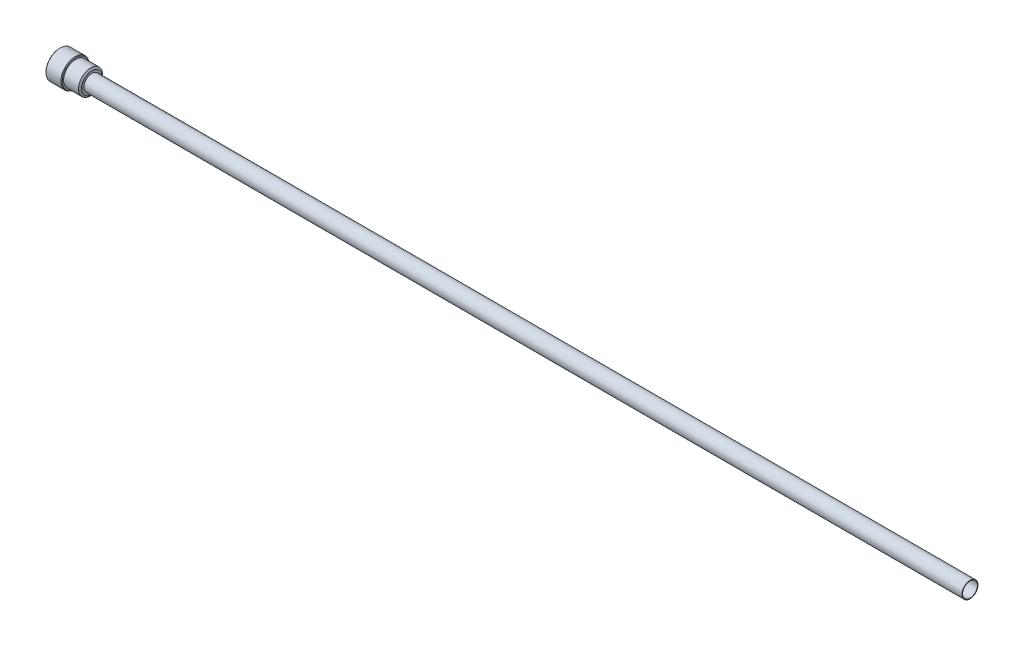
ISO-10303-21;
HEADER;
FILE_DESCRIPTION(('STEP AP214'),'2;1');
FILE_NAME('part.step','',(''),(''),'','','');
FILE_SCHEMA(('AUTOMOTIVE_DESIGN { 1 0 10303 214 1 1 1 1 }'));
ENDSEC;
DATA;
#1=APPLICATION_CONTEXT('core data for automotive mechanical design processes');
#2=APPLICATION_PROTOCOL_DEFINITION('international standard','automotive_design',2000,#1);
#3=PRODUCT_CONTEXT('',#1,'mechanical');
#4=PRODUCT('Part','Part','',(#3));
#5=PRODUCT_RELATED_PRODUCT_CATEGORY('part','',(#4));
#6=PRODUCT_DEFINITION_FORMATION('','',#4);
#7=PRODUCT_DEFINITION_CONTEXT('part definition',#1,'design');
#8=PRODUCT_DEFINITION('design','',#6,#7);
#9=PRODUCT_DEFINITION_SHAPE('','',#8);
#10=(LENGTH_UNIT() NAMED_UNIT(*) SI_UNIT(.MILLI.,.METRE.));
#11=(NAMED_UNIT(*) PLANE_ANGLE_UNIT() SI_UNIT($,.RADIAN.));
#12=(NAMED_UNIT(*) SI_UNIT($,.STERADIAN.) SOLID_ANGLE_UNIT());
#13=UNCERTAINTY_MEASURE_WITH_UNIT(LENGTH_MEASURE(1.E-05),#10,'distance_accuracy_value','');
#14=(GEOMETRIC_REPRESENTATION_CONTEXT(3) GLOBAL_UNCERTAINTY_ASSIGNED_CONTEXT((#13)) GLOBAL_UNIT_ASSIGNED_CONTEXT((#10,
#11,#12)) REPRESENTATION_CONTEXT('',''));
#15=CARTESIAN_POINT('',(0.,0.,0.));
#16=DIRECTION('',(0.,0.,1.));
#17=DIRECTION('',(1.,0.,0.));
#18=AXIS2_PLACEMENT_3D('',#15,#16,#17);
#19=CARTESIAN_POINT('',(0.,0.,0.));
#20=DIRECTION('',(-1.,0.,0.));
#21=DIRECTION('',(0.,0.,1.));
#22=AXIS2_PLACEMENT_3D('',#19,#20,#21);
#23=CONICAL_SURFACE('',#22,4.59999999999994,0.785398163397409);
#24=CARTESIAN_POINT('',(-0.000200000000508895,3.96758228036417,-2.32811745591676));
#25=CARTESIAN_POINT('',(0.0770394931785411,3.83202612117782,-2.40638084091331));
#26=CARTESIAN_POINT('',(0.149654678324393,3.69422306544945,-2.48594147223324));
#27=CARTESIAN_POINT('',(0.282453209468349,3.41334042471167,-2.64810914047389));
#28=CARTESIAN_POINT('',(0.342565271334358,3.27023578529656,-2.73073064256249));
#29=CARTESIAN_POINT('',(0.445444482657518,2.98169480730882,-2.89731985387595));
#30=CARTESIAN_POINT('',(0.488462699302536,2.83632753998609,-2.98124768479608));
#31=CARTESIAN_POINT('',(0.55464811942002,2.54248765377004,-3.15089622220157));
#32=CARTESIAN_POINT('',(0.577862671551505,2.39402331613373,-3.23661214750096));
#33=CARTESIAN_POINT('',(0.598847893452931,2.13654093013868,-3.38526967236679));
#34=CARTESIAN_POINT('',(0.601837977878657,2.02783001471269,-3.44803394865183));
#35=CARTESIAN_POINT('',(0.595987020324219,1.81060401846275,-3.57344943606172));
#36=CARTESIAN_POINT('',(0.587141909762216,1.7020890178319,-3.63610060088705));
#37=CARTESIAN_POINT('',(0.558126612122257,1.48610778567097,-3.76079742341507));
#38=CARTESIAN_POINT('',(0.537944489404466,1.37864278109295,-3.82284237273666));
#39=CARTESIAN_POINT('',(0.487352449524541,1.16556616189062,-3.94586221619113));
#40=CARTESIAN_POINT('',(0.4569433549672,1.05995439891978,-4.00683719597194));
#41=CARTESIAN_POINT('',(0.395534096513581,0.875728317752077,-4.11320017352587));
#42=CARTESIAN_POINT('',(0.366379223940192,0.796643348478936,-4.15885990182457));
#43=CARTESIAN_POINT('',(0.303546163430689,0.639837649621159,-4.24939171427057));
#44=CARTESIAN_POINT('',(0.269868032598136,0.562116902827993,-4.29426380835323));
#45=CARTESIAN_POINT('',(0.198699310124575,0.408289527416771,-4.38307608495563));
#46=CARTESIAN_POINT('',(0.161221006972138,0.332178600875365,-4.42701874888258));
#47=CARTESIAN_POINT('',(0.0829037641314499,0.18130797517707,-4.5141239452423));
#48=CARTESIAN_POINT('',(0.0420665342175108,0.106547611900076,-4.55728686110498));
#49=CARTESIAN_POINT('',(-0.000200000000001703,0.0324177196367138,-4.60008577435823));
#50=B_SPLINE_CURVE_WITH_KNOTS('',3,(#24,#25,#26,#27,#28,#29,#30,#31,#32,#33,#34,#35,#36,#37,#38,
#39,#40,#41,#42,#43,#44,#45,#46,#47,#48,#49),.UNSPECIFIED.,.F.,.F.,(4,2,2,2,2,2,2,2,2,2,2,2,4),
(0.,0.523989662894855,1.05088947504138,1.56973581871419,2.08733814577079,2.46349746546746,
2.83978613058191,3.21647169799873,3.59312697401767,3.88058628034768,4.16804195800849,
4.45459607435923,4.74100521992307),.UNSPECIFIED.);
#51=CARTESIAN_POINT('',(0.,3.96723155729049,-2.32831994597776));
#52=VERTEX_POINT('',#51);
#53=CARTESIAN_POINT('',(0.,0.0327684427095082,-4.59988328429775));
#54=VERTEX_POINT('',#53);
#55=EDGE_CURVE('E12',#52,#54,#50,.T.);
#56=ORIENTED_EDGE('',*,*,#55,.F.);
#57=CARTESIAN_POINT('',(0.,0.,0.));
#58=DIRECTION('',(1.,0.,0.));
#59=DIRECTION('',(0.,0.,-1.));
#60=AXIS2_PLACEMENT_3D('',#57,#58,#59);
#61=CIRCLE('',#60,4.59999999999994);
#62=EDGE_CURVE('E190',#54,#52,#61,.T.);
#63=ORIENTED_EDGE('',*,*,#62,.F.);
#64=EDGE_LOOP('',(#56,#63));
#65=FACE_BOUND('',#64,.T.);
#66=ADVANCED_FACE('F33',(#65),#23,.F.);
#67=CARTESIAN_POINT('',(-0.000200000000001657,-0.032417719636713,-4.60008577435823));
#68=CARTESIAN_POINT('',(0.0770394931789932,-0.167973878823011,-4.52182238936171));
#69=CARTESIAN_POINT('',(0.149654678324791,-0.305776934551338,-4.44226175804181));
#70=CARTESIAN_POINT('',(0.282453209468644,-0.586659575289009,-4.28009408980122));
#71=CARTESIAN_POINT('',(0.342565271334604,-0.729764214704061,-4.19747258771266));
#72=CARTESIAN_POINT('',(0.445444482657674,-1.01830519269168,-4.03088337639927));
#73=CARTESIAN_POINT('',(0.488462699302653,-1.16367246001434,-3.94695554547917));
#74=CARTESIAN_POINT('',(0.554648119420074,-1.45751234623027,-3.77730700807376));
#75=CARTESIAN_POINT('',(0.577862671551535,-1.60597668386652,-3.69159108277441));
#76=CARTESIAN_POINT('',(0.598847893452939,-1.8634590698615,-3.54293355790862));
#77=CARTESIAN_POINT('',(0.601837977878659,-1.97216998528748,-3.48016928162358));
#78=CARTESIAN_POINT('',(0.595987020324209,-2.18939598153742,-3.35475379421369));
#79=CARTESIAN_POINT('',(0.5871419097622,-2.29791098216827,-3.29210262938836));
#80=CARTESIAN_POINT('',(0.558126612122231,-2.51389221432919,-3.16740580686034));
#81=CARTESIAN_POINT('',(0.537944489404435,-2.62135721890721,-3.10536085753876));
#82=CARTESIAN_POINT('',(0.487352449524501,-2.83443383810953,-2.98234101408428));
#83=CARTESIAN_POINT('',(0.456943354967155,-2.94004560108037,-2.92136603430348));
#84=CARTESIAN_POINT('',(0.395534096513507,-3.12427168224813,-2.81500305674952));
#85=CARTESIAN_POINT('',(0.366379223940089,-3.20335665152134,-2.76934332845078));
#86=CARTESIAN_POINT('',(0.303546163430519,-3.36016235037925,-2.6788115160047));
#87=CARTESIAN_POINT('',(0.269868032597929,-3.43788309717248,-2.63393942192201));
#88=CARTESIAN_POINT('',(0.198699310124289,-3.59171047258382,-2.54512714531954));
#89=CARTESIAN_POINT('',(0.161221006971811,-3.66782139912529,-2.50118448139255));
#90=CARTESIAN_POINT('',(0.0829037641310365,-3.8186920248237,-2.41407928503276));
#91=CARTESIAN_POINT('',(0.0420665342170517,-3.89345238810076,-2.37091636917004));
#92=CARTESIAN_POINT('',(-0.000200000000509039,-3.96758228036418,-2.32811745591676));
#93=B_SPLINE_CURVE_WITH_KNOTS('',3,(#67,#68,#69,#70,#71,#72,#73,#74,#75,#76,#77,#78,#79,#80,#81,
#82,#83,#84,#85,#86,#87,#88,#89,#90,#91,#92),.UNSPECIFIED.,.F.,.F.,(4,2,2,2,2,2,2,2,2,2,2,2,4),
(0.,0.523989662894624,1.05088947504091,1.56973581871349,2.08733814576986,2.46349746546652,
2.83978613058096,3.21647169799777,3.59312697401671,3.88058628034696,4.16804195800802,
4.45459607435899,4.74100521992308),.UNSPECIFIED.);
#94=CARTESIAN_POINT('',(0.,-0.0327684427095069,-4.59988328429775));
#95=VERTEX_POINT('',#94);
#96=CARTESIAN_POINT('',(0.,-3.96723155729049,-2.32831994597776));
#97=VERTEX_POINT('',#96);
#98=EDGE_CURVE('E46',#95,#97,#93,.T.);
#99=ORIENTED_EDGE('',*,*,#98,.F.);
#100=EDGE_CURVE('E187',#97,#95,#61,.T.);
#101=ORIENTED_EDGE('',*,*,#100,.F.);
#102=EDGE_LOOP('',(#99,#101));
#103=FACE_BOUND('',#102,.T.);
#104=ADVANCED_FACE('F293',(#103),#23,.F.);
#105=CARTESIAN_POINT('',(-1.65737932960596,-4.,-4.81194306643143));
#106=CARTESIAN_POINT('',(-1.56797699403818,-4.,-4.69565947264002));
#107=CARTESIAN_POINT('',(-1.47937788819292,-4.,-4.57874845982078));
#108=CARTESIAN_POINT('',(-1.30415284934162,-4.,-4.34341545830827));
#109=CARTESIAN_POINT('',(-1.21752738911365,-4.,-4.22499311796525));
#110=CARTESIAN_POINT('',(-1.04599986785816,-4.,-3.98551584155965));
#111=CARTESIAN_POINT('',(-0.961116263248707,-4.,-3.86444764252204));
#112=CARTESIAN_POINT('',(-0.794310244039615,-4.,-3.62029483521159));
#113=CARTESIAN_POINT('',(-0.712387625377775,-4.,-3.49721036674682));
#114=CARTESIAN_POINT('',(-0.547116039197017,-4.,-3.24083487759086));
#115=CARTESIAN_POINT('',(-0.464004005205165,-4.,-3.10739034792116));
#116=CARTESIAN_POINT('',(-0.302949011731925,-4.,-2.83736805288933));
#117=CARTESIAN_POINT('',(-0.225006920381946,-4.,-2.70078976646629));
#118=CARTESIAN_POINT('',(-0.0759524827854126,-4.,-2.42446434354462));
#119=CARTESIAN_POINT('',(-0.00482008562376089,-4.,-2.28472810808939));
#120=CARTESIAN_POINT('',(0.129021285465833,-4.,-2.00131014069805));
#121=CARTESIAN_POINT('',(0.191734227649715,-4.,-1.85763030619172));
#122=CARTESIAN_POINT('',(0.300838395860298,-4.,-1.58031488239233));
#123=CARTESIAN_POINT('',(0.34822705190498,-4.,-1.44707574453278));
#124=CARTESIAN_POINT('',(0.432338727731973,-4.,-1.17720941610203));
#125=CARTESIAN_POINT('',(0.469061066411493,-4.,-1.0405820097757));
#126=CARTESIAN_POINT('',(0.529242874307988,-4.,-0.767130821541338));
#127=CARTESIAN_POINT('',(0.552942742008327,-4.,-0.630360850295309));
#128=CARTESIAN_POINT('',(0.586586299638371,-4.,-0.355129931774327));
#129=CARTESIAN_POINT('',(0.596532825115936,-4.,-0.216669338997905));
#130=CARTESIAN_POINT('',(0.601826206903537,-4.,0.0545157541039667));
#131=CARTESIAN_POINT('',(0.597788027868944,-4.,0.187228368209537));
#132=CARTESIAN_POINT('',(0.576744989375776,-4.,0.451614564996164));
#133=CARTESIAN_POINT('',(0.559738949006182,-4.,0.583288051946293));
#134=CARTESIAN_POINT('',(0.513431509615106,-4.,0.846874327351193));
#135=CARTESIAN_POINT('',(0.483913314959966,-4.,0.978748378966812));
#136=CARTESIAN_POINT('',(0.414216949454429,-4.,1.23959359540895));
#137=CARTESIAN_POINT('',(0.374039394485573,-4.,1.36856492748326));
#138=CARTESIAN_POINT('',(0.282162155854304,-4.,1.63085879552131));
#139=CARTESIAN_POINT('',(0.229923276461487,-4.,1.76399030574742));
#140=CARTESIAN_POINT('',(0.117376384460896,-4.,2.02682798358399));
#141=CARTESIAN_POINT('',(0.057064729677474,-4.,2.156532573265));
#142=CARTESIAN_POINT('',(-0.070197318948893,-4.,2.41312958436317));
#143=CARTESIAN_POINT('',(-0.137168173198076,-4.,2.54001177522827));
#144=CARTESIAN_POINT('',(-0.276274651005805,-4.,2.7908683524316));
#145=CARTESIAN_POINT('',(-0.348409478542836,-4.,2.91484318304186));
#146=CARTESIAN_POINT('',(-0.493170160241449,-4.,3.15420495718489));
#147=CARTESIAN_POINT('',(-0.565595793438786,-4.,3.26971363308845));
#148=CARTESIAN_POINT('',(-0.713528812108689,-4.,3.49874649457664));
#149=CARTESIAN_POINT('',(-0.789036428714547,-4.,3.61227053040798));
#150=CARTESIAN_POINT('',(-0.941968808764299,-4.,3.83668078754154));
#151=CARTESIAN_POINT('',(-1.01937330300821,-4.,3.94758087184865));
#152=CARTESIAN_POINT('',(-1.17625644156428,-4.,4.16785980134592));
#153=CARTESIAN_POINT('',(-1.25573450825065,-4.,4.27723905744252));
#154=CARTESIAN_POINT('',(-1.3360613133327,-4.,4.38598038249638));
#155=B_SPLINE_CURVE_WITH_KNOTS('',3,(#105,#106,#107,#108,#109,#110,#111,#112,#113,#114,#115,
#116,#117,#118,#119,#120,#121,#122,#123,#124,#125,#126,#127,#128,#129,#130,#131,#132,#133,#134,
#135,#136,#137,#138,#139,#140,#141,#142,#143,#144,#145,#146,#147,#148,#149,#150,#151,#152,#153,
#154),.UNSPECIFIED.,.F.,.F.,(4,2,2,2,2,2,2,2,2,2,2,2,2,2,2,2,2,2,2,2,2,2,2,2,4),(0.,
0.440044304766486,0.880192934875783,1.32373793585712,1.76725231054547,2.2387898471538,
2.71040636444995,3.18058851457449,3.65054827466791,4.0744289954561,4.49833677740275,
4.91413096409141,5.32983941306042,5.72750387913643,6.12520456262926,6.53009753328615,
6.93496711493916,7.36367914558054,7.79258525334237,8.22285247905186,8.65305352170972,
9.06200662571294,9.47099045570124,9.87668939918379,10.2822765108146),.UNSPECIFIED.);
#156=CARTESIAN_POINT('',(0.,-4.,-2.27156333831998));
#157=VERTEX_POINT('',#156);
#158=CARTESIAN_POINT('',(0.,-4.,2.27156333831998));
#159=VERTEX_POINT('',#158);
#160=EDGE_CURVE('E267',#157,#159,#155,.T.);
#161=ORIENTED_EDGE('',*,*,#160,.F.);
#162=EDGE_CURVE('E294',#159,#157,#61,.T.);
#163=ORIENTED_EDGE('',*,*,#162,.F.);
#164=EDGE_LOOP('',(#161,#163));
#165=FACE_BOUND('',#164,.T.);
#166=ADVANCED_FACE('F340',(#165),#23,.F.);
#167=CARTESIAN_POINT('',(-0.000200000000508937,-3.96758228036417,2.32811745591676));
#168=CARTESIAN_POINT('',(0.0770394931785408,-3.83202612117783,2.40638084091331));
#169=CARTESIAN_POINT('',(0.149654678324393,-3.69422306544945,2.48594147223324));
#170=CARTESIAN_POINT('',(0.282453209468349,-3.41334042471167,2.64810914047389));
#171=CARTESIAN_POINT('',(0.342565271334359,-3.27023578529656,2.73073064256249));
#172=CARTESIAN_POINT('',(0.445444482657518,-2.98169480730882,2.89731985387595));
#173=CARTESIAN_POINT('',(0.488462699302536,-2.8363275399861,2.98124768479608));
#174=CARTESIAN_POINT('',(0.55464811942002,-2.54248765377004,3.15089622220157));
#175=CARTESIAN_POINT('',(0.577862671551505,-2.39402331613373,3.23661214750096));
#176=CARTESIAN_POINT('',(0.59884789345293,-2.13654093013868,3.38526967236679));
#177=CARTESIAN_POINT('',(0.601837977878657,-2.02783001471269,3.44803394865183));
#178=CARTESIAN_POINT('',(0.595987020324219,-1.81060401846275,3.57344943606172));
#179=CARTESIAN_POINT('',(0.587141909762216,-1.7020890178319,3.63610060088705));
#180=CARTESIAN_POINT('',(0.558126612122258,-1.48610778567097,3.76079742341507));
#181=CARTESIAN_POINT('',(0.537944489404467,-1.37864278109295,3.82284237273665));
#182=CARTESIAN_POINT('',(0.487352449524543,-1.16556616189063,3.94586221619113));
#183=CARTESIAN_POINT('',(0.4569433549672,-1.05995439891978,4.00683719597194));
#184=CARTESIAN_POINT('',(0.395534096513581,-0.875728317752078,4.11320017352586));
#185=CARTESIAN_POINT('',(0.366379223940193,-0.796643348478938,4.15885990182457));
#186=CARTESIAN_POINT('',(0.30354616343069,-0.63983764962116,4.24939171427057));
#187=CARTESIAN_POINT('',(0.269868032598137,-0.562116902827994,4.29426380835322));
#188=CARTESIAN_POINT('',(0.198699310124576,-0.408289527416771,4.38307608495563));
#189=CARTESIAN_POINT('',(0.161221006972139,-0.332178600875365,4.42701874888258));
#190=CARTESIAN_POINT('',(0.0829037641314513,-0.181307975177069,4.5141239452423));
#191=CARTESIAN_POINT('',(0.042066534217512,-0.106547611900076,4.55728686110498));
#192=CARTESIAN_POINT('',(-0.000200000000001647,-0.0324177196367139,4.60008577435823));
#193=B_SPLINE_CURVE_WITH_KNOTS('',3,(#167,#168,#169,#170,#171,#172,#173,#174,#175,#176,#177,
#178,#179,#180,#181,#182,#183,#184,#185,#186,#187,#188,#189,#190,#191,#192),.UNSPECIFIED.,.F.,
.F.,(4,2,2,2,2,2,2,2,2,2,2,2,4),(0.,0.523989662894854,1.05088947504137,1.56973581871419,
2.08733814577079,2.46349746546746,2.83978613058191,3.21647169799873,3.59312697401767,
3.88058628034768,4.16804195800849,4.45459607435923,4.74100521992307),.UNSPECIFIED.);
#194=CARTESIAN_POINT('',(0.,-3.96723155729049,2.32831994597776));
#195=VERTEX_POINT('',#194);
#196=CARTESIAN_POINT('',(0.,-0.0327684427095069,4.59988328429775));
#197=VERTEX_POINT('',#196);
#198=EDGE_CURVE('E271',#195,#197,#193,.T.);
#199=ORIENTED_EDGE('',*,*,#198,.F.);
#200=EDGE_CURVE('E295',#197,#195,#61,.T.);
#201=ORIENTED_EDGE('',*,*,#200,.F.);
#202=EDGE_LOOP('',(#199,#201));
#203=FACE_BOUND('',#202,.T.);
#204=ADVANCED_FACE('F338',(#203),#23,.F.);
#205=CARTESIAN_POINT('',(-0.000200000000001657,0.0324177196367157,4.60008577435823));
#206=CARTESIAN_POINT('',(0.0770394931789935,0.167973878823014,4.52182238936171));
#207=CARTESIAN_POINT('',(0.149654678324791,0.305776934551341,4.44226175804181));
#208=CARTESIAN_POINT('',(0.282453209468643,0.586659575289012,4.28009408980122));
#209=CARTESIAN_POINT('',(0.342565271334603,0.729764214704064,4.19747258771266));
#210=CARTESIAN_POINT('',(0.445444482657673,1.01830519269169,4.03088337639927));
#211=CARTESIAN_POINT('',(0.488462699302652,1.16367246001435,3.94695554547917));
#212=CARTESIAN_POINT('',(0.554648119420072,1.45751234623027,3.77730700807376));
#213=CARTESIAN_POINT('',(0.577862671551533,1.60597668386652,3.69159108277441));
#214=CARTESIAN_POINT('',(0.598847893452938,1.8634590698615,3.54293355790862));
#215=CARTESIAN_POINT('',(0.601837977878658,1.97216998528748,3.48016928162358));
#216=CARTESIAN_POINT('',(0.595987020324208,2.18939598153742,3.35475379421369));
#217=CARTESIAN_POINT('',(0.587141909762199,2.29791098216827,3.29210262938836));
#218=CARTESIAN_POINT('',(0.558126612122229,2.51389221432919,3.16740580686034));
#219=CARTESIAN_POINT('',(0.537944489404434,2.62135721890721,3.10536085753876));
#220=CARTESIAN_POINT('',(0.4873524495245,2.83443383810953,2.98234101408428));
#221=CARTESIAN_POINT('',(0.456943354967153,2.94004560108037,2.92136603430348));
#222=CARTESIAN_POINT('',(0.395534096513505,3.12427168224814,2.81500305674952));
#223=CARTESIAN_POINT('',(0.366379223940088,3.20335665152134,2.76934332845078));
#224=CARTESIAN_POINT('',(0.303546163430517,3.36016235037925,2.6788115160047));
#225=CARTESIAN_POINT('',(0.269868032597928,3.43788309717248,2.63393942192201));
#226=CARTESIAN_POINT('',(0.198699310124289,3.59171047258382,2.54512714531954));
#227=CARTESIAN_POINT('',(0.16122100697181,3.66782139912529,2.50118448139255));
#228=CARTESIAN_POINT('',(0.0829037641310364,3.8186920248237,2.41407928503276));
#229=CARTESIAN_POINT('',(0.0420665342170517,3.89345238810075,2.37091636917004));
#230=CARTESIAN_POINT('',(-0.000200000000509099,3.96758228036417,2.32811745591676));
#231=B_SPLINE_CURVE_WITH_KNOTS('',3,(#205,#206,#207,#208,#209,#210,#211,#212,#213,#214,#215,
#216,#217,#218,#219,#220,#221,#222,#223,#224,#225,#226,#227,#228,#229,#230),.UNSPECIFIED.,.F.,
.F.,(4,2,2,2,2,2,2,2,2,2,2,2,4),(0.,0.523989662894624,1.05088947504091,1.56973581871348,
2.08733814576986,2.46349746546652,2.83978613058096,3.21647169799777,3.59312697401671,
3.88058628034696,4.16804195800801,4.45459607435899,4.74100521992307),.UNSPECIFIED.);
#232=CARTESIAN_POINT('',(0.,0.03276844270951,4.59988328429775));
#233=VERTEX_POINT('',#232);
#234=CARTESIAN_POINT('',(0.,3.96723155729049,2.32831994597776));
#235=VERTEX_POINT('',#234);
#236=EDGE_CURVE('E200',#233,#235,#231,.T.);
#237=ORIENTED_EDGE('',*,*,#236,.F.);
#238=EDGE_CURVE('E299',#235,#233,#61,.T.);
#239=ORIENTED_EDGE('',*,*,#238,.F.);
#240=EDGE_LOOP('',(#237,#239));
#241=FACE_BOUND('',#240,.T.);
#242=ADVANCED_FACE('F332',(#241),#23,.F.);
#243=CARTESIAN_POINT('',(16.,5.035,0.));
#244=DIRECTION('',(-1.,0.,0.));
#245=DIRECTION('',(0.,0.,1.));
#246=AXIS2_PLACEMENT_3D('',#243,#244,#245);
#247=PLANE('',#246);
#248=CARTESIAN_POINT('',(16.,0.,0.));
#249=DIRECTION('',(-1.,0.,0.));
#250=DIRECTION('',(0.,0.,1.));
#251=AXIS2_PLACEMENT_3D('',#248,#249,#250);
#252=CIRCLE('',#251,5.035);
#253=CARTESIAN_POINT('',(16.,0.,5.035));
#254=VERTEX_POINT('',#253);
#255=EDGE_CURVE('E172',#254,#254,#252,.T.);
#256=ORIENTED_EDGE('',*,*,#255,.F.);
#257=EDGE_LOOP('',(#256));
#258=FACE_BOUND('',#257,.T.);
#259=CARTESIAN_POINT('',(16.,0.,0.));
#260=DIRECTION('',(-1.,0.,0.));
#261=DIRECTION('',(0.,0.,1.));
#262=AXIS2_PLACEMENT_3D('',#259,#260,#261);
#263=CIRCLE('',#262,3.9751);
#264=CARTESIAN_POINT('',(16.,0.,3.9751));
#265=VERTEX_POINT('',#264);
#266=EDGE_CURVE('E154',#265,#265,#263,.T.);
#267=ORIENTED_EDGE('',*,*,#266,.T.);
#268=EDGE_LOOP('',(#267));
#269=FACE_BOUND('',#268,.T.);
#270=ADVANCED_FACE('F345',(#258,#269),#247,.F.);
#271=CARTESIAN_POINT('',(-22.2121854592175,0.,0.));
#272=DIRECTION('',(-1.,0.,0.));
#273=DIRECTION('',(0.,0.,1.));
#274=AXIS2_PLACEMENT_3D('',#271,#272,#273);
#275=CYLINDRICAL_SURFACE('',#274,5.035);
#276=CARTESIAN_POINT('',(15.9,0.,0.));
#277=DIRECTION('',(-1.,0.,0.));
#278=DIRECTION('',(0.,0.,1.));
#279=AXIS2_PLACEMENT_3D('',#276,#277,#278);
#280=CIRCLE('',#279,5.035);
#281=CARTESIAN_POINT('',(15.9,0.,5.035));
#282=VERTEX_POINT('',#281);
#283=EDGE_CURVE('E169',#282,#282,#280,.T.);
#284=ORIENTED_EDGE('',*,*,#283,.F.);
#285=EDGE_LOOP('',(#284));
#286=FACE_BOUND('',#285,.T.);
#287=ORIENTED_EDGE('',*,*,#255,.T.);
#288=EDGE_LOOP('',(#287));
#289=FACE_BOUND('',#288,.T.);
#290=ADVANCED_FACE('F497',(#286,#289),#275,.T.);
#291=CARTESIAN_POINT('',(15.9,0.,0.));
#292=DIRECTION('',(-1.,0.,0.));
#293=DIRECTION('',(0.,0.,1.));
#294=AXIS2_PLACEMENT_3D('',#291,#292,#293);
#295=CONICAL_SURFACE('',#294,5.035,1.0471975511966);
#296=CARTESIAN_POINT('',(15.342856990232,0.,0.));
#297=DIRECTION('',(-1.,0.,0.));
#298=DIRECTION('',(0.,0.,1.));
#299=AXIS2_PLACEMENT_3D('',#296,#297,#298);
#300=CIRCLE('',#299,6.);
#301=CARTESIAN_POINT('',(15.342856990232,0.,6.));
#302=VERTEX_POINT('',#301);
#303=EDGE_CURVE('E166',#302,#302,#300,.T.);
#304=ORIENTED_EDGE('',*,*,#303,.F.);
#305=EDGE_LOOP('',(#304));
#306=FACE_BOUND('',#305,.T.);
#307=ORIENTED_EDGE('',*,*,#283,.T.);
#308=EDGE_LOOP('',(#307));
#309=FACE_BOUND('',#308,.T.);
#310=ADVANCED_FACE('F501',(#306,#309),#295,.T.);
#311=CARTESIAN_POINT('',(-22.2121854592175,0.,0.));
#312=DIRECTION('',(-1.,0.,0.));
#313=DIRECTION('',(0.,0.,1.));
#314=AXIS2_PLACEMENT_3D('',#311,#312,#313);
#315=CYLINDRICAL_SURFACE('',#314,6.);
#316=CARTESIAN_POINT('',(8.,0.,0.));
#317=DIRECTION('',(-1.,0.,0.));
#318=DIRECTION('',(0.,0.,1.));
#319=AXIS2_PLACEMENT_3D('',#316,#317,#318);
#320=CIRCLE('',#319,6.);
#321=CARTESIAN_POINT('',(8.,0.,6.));
#322=VERTEX_POINT('',#321);
#323=EDGE_CURVE('E163',#322,#322,#320,.T.);
#324=ORIENTED_EDGE('',*,*,#323,.F.);
#325=EDGE_LOOP('',(#324));
#326=FACE_BOUND('',#325,.T.);
#327=ORIENTED_EDGE('',*,*,#303,.T.);
#328=EDGE_LOOP('',(#327));
#329=FACE_BOUND('',#328,.T.);
#330=ADVANCED_FACE('F505',(#326,#329),#315,.T.);
#331=CARTESIAN_POINT('',(8.,6.,0.));
#332=DIRECTION('',(-1.,0.,0.));
#333=DIRECTION('',(0.,0.,1.));
#334=AXIS2_PLACEMENT_3D('',#331,#332,#333);
#335=PLANE('',#334);
#336=CARTESIAN_POINT('',(8.,0.,0.));
#337=DIRECTION('',(-1.,0.,0.));
#338=DIRECTION('',(0.,0.,1.));
#339=AXIS2_PLACEMENT_3D('',#336,#337,#338);
#340=CIRCLE('',#339,6.69999999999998);
#341=CARTESIAN_POINT('',(8.,0.,6.69999999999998));
#342=VERTEX_POINT('',#341);
#343=EDGE_CURVE('E181',#342,#342,#340,.F.);
#344=ORIENTED_EDGE('',*,*,#343,.T.);
#345=EDGE_LOOP('',(#344));
#346=FACE_BOUND('',#345,.T.);
#347=ORIENTED_EDGE('',*,*,#323,.T.);
#348=EDGE_LOOP('',(#347));
#349=FACE_BOUND('',#348,.T.);
#350=ADVANCED_FACE('F509',(#346,#349),#335,.F.);
#351=CARTESIAN_POINT('',(-22.2121854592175,0.,0.));
#352=DIRECTION('',(-1.,0.,0.));
#353=DIRECTION('',(0.,0.,1.));
#354=AXIS2_PLACEMENT_3D('',#351,#352,#353);
#355=CYLINDRICAL_SURFACE('',#354,7.);
#356=CARTESIAN_POINT('',(7.69999999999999,0.,0.));
#357=DIRECTION('',(-1.,0.,0.));
#358=DIRECTION('',(0.,0.,1.));
#359=AXIS2_PLACEMENT_3D('',#356,#357,#358);
#360=CIRCLE('',#359,7.);
#361=CARTESIAN_POINT('',(7.69999999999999,0.,7.));
#362=VERTEX_POINT('',#361);
#363=EDGE_CURVE('E178',#362,#362,#360,.T.);
#364=ORIENTED_EDGE('',*,*,#363,.T.);
#365=EDGE_LOOP('',(#364));
#366=FACE_BOUND('',#365,.T.);
#367=CARTESIAN_POINT('',(0.300000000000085,0.,0.));
#368=DIRECTION('',(1.,0.,0.));
#369=DIRECTION('',(0.,0.,-1.));
#370=AXIS2_PLACEMENT_3D('',#367,#368,#369);
#371=CIRCLE('',#370,7.);
#372=CARTESIAN_POINT('',(0.300000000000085,0.,-7.));
#373=VERTEX_POINT('',#372);
#374=EDGE_CURVE('E175',#373,#373,#371,.T.);
#375=ORIENTED_EDGE('',*,*,#374,.T.);
#376=EDGE_LOOP('',(#375));
#377=FACE_BOUND('',#376,.T.);
#378=ADVANCED_FACE('F438',(#366,#377),#355,.T.);
#379=CARTESIAN_POINT('',(0.,3.65759999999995,0.));
#380=DIRECTION('',(1.,0.,0.));
#381=DIRECTION('',(0.,0.,-1.));
#382=AXIS2_PLACEMENT_3D('',#379,#380,#381);
#383=PLANE('',#382);
#384=DIRECTION('',(0.,-0.866025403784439,0.5));
#385=VECTOR('',#384,1.);
#386=CARTESIAN_POINT('',(0.,0.,-4.618802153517));
#387=LINE('',#386,#385);
#388=CARTESIAN_POINT('',(0.,0.,-4.618802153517));
#389=VERTEX_POINT('',#388);
#390=EDGE_CURVE('E280',#389,#95,#387,.T.);
#391=ORIENTED_EDGE('',*,*,#390,.F.);
#392=DIRECTION('',(0.,-0.866025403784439,-0.5));
#393=VECTOR('',#392,1.);
#394=CARTESIAN_POINT('',(0.,4.,-2.3094010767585));
#395=LINE('',#394,#393);
#396=EDGE_CURVE('E146',#54,#389,#395,.T.);
#397=ORIENTED_EDGE('',*,*,#396,.F.);
#398=ORIENTED_EDGE('',*,*,#62,.T.);
#399=CARTESIAN_POINT('',(0.,4.,-2.3094010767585));
#400=VERTEX_POINT('',#399);
#401=EDGE_CURVE('E291',#400,#52,#395,.T.);
#402=ORIENTED_EDGE('',*,*,#401,.F.);
#403=DIRECTION('',(0.,0.,-1.));
#404=VECTOR('',#403,1.);
#405=CARTESIAN_POINT('',(0.,4.,2.3094010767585));
#406=LINE('',#405,#404);
#407=CARTESIAN_POINT('',(0.,4.,-2.27156333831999));
#408=VERTEX_POINT('',#407);
#409=EDGE_CURVE('E314',#408,#400,#406,.T.);
#410=ORIENTED_EDGE('',*,*,#409,.F.);
#411=CARTESIAN_POINT('',(0.,4.,2.27156333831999));
#412=VERTEX_POINT('',#411);
#413=EDGE_CURVE('E194',#408,#412,#61,.T.);
#414=ORIENTED_EDGE('',*,*,#413,.T.);
#415=CARTESIAN_POINT('',(0.,4.,2.3094010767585));
#416=VERTEX_POINT('',#415);
#417=EDGE_CURVE('E312',#416,#412,#406,.T.);
#418=ORIENTED_EDGE('',*,*,#417,.F.);
#419=DIRECTION('',(0.,0.866025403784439,-0.5));
#420=VECTOR('',#419,1.);
#421=CARTESIAN_POINT('',(0.,0.,4.61880215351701));
#422=LINE('',#421,#420);
#423=EDGE_CURVE('E326',#235,#416,#422,.T.);
#424=ORIENTED_EDGE('',*,*,#423,.F.);
#425=ORIENTED_EDGE('',*,*,#238,.T.);
#426=CARTESIAN_POINT('',(0.,0.,4.61880215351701));
#427=VERTEX_POINT('',#426);
#428=EDGE_CURVE('E134',#427,#233,#422,.T.);
#429=ORIENTED_EDGE('',*,*,#428,.F.);
#430=DIRECTION('',(0.,0.866025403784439,0.5));
#431=VECTOR('',#430,1.);
#432=CARTESIAN_POINT('',(0.,-4.,2.3094010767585));
#433=LINE('',#432,#431);
#434=EDGE_CURVE('E322',#197,#427,#433,.T.);
#435=ORIENTED_EDGE('',*,*,#434,.F.);
#436=ORIENTED_EDGE('',*,*,#200,.T.);
#437=CARTESIAN_POINT('',(0.,-4.,2.3094010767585));
#438=VERTEX_POINT('',#437);
#439=EDGE_CURVE('E323',#438,#195,#433,.T.);
#440=ORIENTED_EDGE('',*,*,#439,.F.);
#441=DIRECTION('',(0.,0.,1.));
#442=VECTOR('',#441,1.);
#443=CARTESIAN_POINT('',(0.,-4.,-2.3094010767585));
#444=LINE('',#443,#442);
#445=EDGE_CURVE('E320',#159,#438,#444,.T.);
#446=ORIENTED_EDGE('',*,*,#445,.F.);
#447=ORIENTED_EDGE('',*,*,#162,.T.);
#448=CARTESIAN_POINT('',(0.,-4.,-2.3094010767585));
#449=VERTEX_POINT('',#448);
#450=EDGE_CURVE('E290',#449,#157,#444,.T.);
#451=ORIENTED_EDGE('',*,*,#450,.F.);
#452=EDGE_CURVE('E279',#97,#449,#387,.T.);
#453=ORIENTED_EDGE('',*,*,#452,.F.);
#454=ORIENTED_EDGE('',*,*,#100,.T.);
#455=EDGE_LOOP('',(#391,#397,#398,#402,#410,#414,#418,#424,#425,#429,#435,#436,#440,#446,#447,
#451,#453,#454));
#456=FACE_BOUND('',#455,.T.);
#457=CARTESIAN_POINT('',(0.,0.,0.));
#458=DIRECTION('',(1.,0.,0.));
#459=DIRECTION('',(0.,0.,-1.));
#460=AXIS2_PLACEMENT_3D('',#457,#458,#459);
#461=CIRCLE('',#460,6.69999999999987);
#462=CARTESIAN_POINT('',(0.,0.,-6.69999999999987));
#463=VERTEX_POINT('',#462);
#464=EDGE_CURVE('E184',#463,#463,#461,.F.);
#465=ORIENTED_EDGE('',*,*,#464,.T.);
#466=EDGE_LOOP('',(#465));
#467=FACE_BOUND('',#466,.T.);
#468=ADVANCED_FACE('F286',(#456,#467),#383,.F.);
#469=CARTESIAN_POINT('',(-22.2121854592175,0.,0.));
#470=DIRECTION('',(-1.,0.,0.));
#471=DIRECTION('',(0.,0.,1.));
#472=AXIS2_PLACEMENT_3D('',#469,#470,#471);
#473=CYLINDRICAL_SURFACE('',#472,3.65759999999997);
#474=CARTESIAN_POINT('',(5.20573467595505,0.,0.));
#475=DIRECTION('',(-1.,0.,0.));
#476=DIRECTION('',(0.,0.,1.));
#477=AXIS2_PLACEMENT_3D('',#474,#475,#476);
#478=CIRCLE('',#477,3.65759999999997);
#479=CARTESIAN_POINT('',(5.20573467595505,0.,3.65759999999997));
#480=VERTEX_POINT('',#479);
#481=EDGE_CURVE('E153',#480,#480,#478,.T.);
#482=ORIENTED_EDGE('',*,*,#481,.T.);
#483=EDGE_LOOP('',(#482));
#484=FACE_BOUND('',#483,.T.);
#485=CARTESIAN_POINT('',(450.,0.,0.));
#486=DIRECTION('',(-1.,0.,0.));
#487=DIRECTION('',(0.,0.,1.));
#488=AXIS2_PLACEMENT_3D('',#485,#486,#487);
#489=CIRCLE('',#488,3.6576);
#490=CARTESIAN_POINT('',(450.,0.,3.6576));
#491=VERTEX_POINT('',#490);
#492=EDGE_CURVE('E160',#491,#491,#489,.T.);
#493=ORIENTED_EDGE('',*,*,#492,.F.);
#494=EDGE_LOOP('',(#493));
#495=FACE_BOUND('',#494,.T.);
#496=ADVANCED_FACE('F437',(#484,#495),#473,.F.);
#497=CARTESIAN_POINT('',(450.,3.9751,0.));
#498=DIRECTION('',(-1.,0.,0.));
#499=DIRECTION('',(0.,0.,1.));
#500=AXIS2_PLACEMENT_3D('',#497,#498,#499);
#501=PLANE('',#500);
#502=CARTESIAN_POINT('',(450.,0.,0.));
#503=DIRECTION('',(-1.,0.,0.));
#504=DIRECTION('',(0.,0.,1.));
#505=AXIS2_PLACEMENT_3D('',#502,#503,#504);
#506=CIRCLE('',#505,3.9751);
#507=CARTESIAN_POINT('',(450.,0.,3.9751));
#508=VERTEX_POINT('',#507);
#509=EDGE_CURVE('E157',#508,#508,#506,.T.);
#510=ORIENTED_EDGE('',*,*,#509,.F.);
#511=EDGE_LOOP('',(#510));
#512=FACE_BOUND('',#511,.T.);
#513=ORIENTED_EDGE('',*,*,#492,.T.);
#514=EDGE_LOOP('',(#513));
#515=FACE_BOUND('',#514,.T.);
#516=ADVANCED_FACE('F452',(#512,#515),#501,.F.);
#517=CARTESIAN_POINT('',(-22.2121854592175,0.,0.));
#518=DIRECTION('',(-1.,0.,0.));
#519=DIRECTION('',(0.,0.,1.));
#520=AXIS2_PLACEMENT_3D('',#517,#518,#519);
#521=CYLINDRICAL_SURFACE('',#520,3.9751);
#522=ORIENTED_EDGE('',*,*,#266,.F.);
#523=EDGE_LOOP('',(#522));
#524=FACE_BOUND('',#523,.T.);
#525=ORIENTED_EDGE('',*,*,#509,.T.);
#526=EDGE_LOOP('',(#525));
#527=FACE_BOUND('',#526,.T.);
#528=ADVANCED_FACE('F236',(#524,#527),#521,.T.);
#529=CARTESIAN_POINT('',(7.69999999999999,0.,0.));
#530=DIRECTION('',(-1.,0.,0.));
#531=DIRECTION('',(0.,0.,1.));
#532=AXIS2_PLACEMENT_3D('',#529,#530,#531);
#533=CONICAL_SURFACE('',#532,7.,0.785398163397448);
#534=ORIENTED_EDGE('',*,*,#343,.F.);
#535=EDGE_LOOP('',(#534));
#536=FACE_BOUND('',#535,.T.);
#537=ORIENTED_EDGE('',*,*,#363,.F.);
#538=EDGE_LOOP('',(#537));
#539=FACE_BOUND('',#538,.T.);
#540=ADVANCED_FACE('F467',(#536,#539),#533,.T.);
#541=CARTESIAN_POINT('',(0.,0.,0.));
#542=DIRECTION('',(1.,0.,0.));
#543=DIRECTION('',(0.,0.,-1.));
#544=AXIS2_PLACEMENT_3D('',#541,#542,#543);
#545=CONICAL_SURFACE('',#544,6.69999999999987,0.785398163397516);
#546=ORIENTED_EDGE('',*,*,#374,.F.);
#547=EDGE_LOOP('',(#546));
#548=FACE_BOUND('',#547,.T.);
#549=ORIENTED_EDGE('',*,*,#464,.F.);
#550=EDGE_LOOP('',(#549));
#551=FACE_BOUND('',#550,.T.);
#552=ADVANCED_FACE('F233',(#548,#551),#545,.T.);
#553=CARTESIAN_POINT('',(7.40344247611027,0.,0.));
#554=DIRECTION('',(-1.,0.,0.));
#555=DIRECTION('',(0.,0.,1.));
#556=AXIS2_PLACEMENT_3D('',#553,#554,#555);
#557=CONICAL_SURFACE('',#556,0.,1.02974425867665);
#558=CARTESIAN_POINT('',(4.62811677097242,-0.000199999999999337,4.61891762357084));
#559=CARTESIAN_POINT('',(4.68933737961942,0.176215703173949,4.51706396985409));
#560=CARTESIAN_POINT('',(4.74504038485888,0.354280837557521,4.41425801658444));
#561=CARTESIAN_POINT('',(4.84224230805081,0.713761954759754,4.20671149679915));
#562=CARTESIAN_POINT('',(4.88370319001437,0.895185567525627,4.10196652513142));
#563=CARTESIAN_POINT('',(4.94801788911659,1.25559566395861,3.89388365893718));
#564=CARTESIAN_POINT('',(4.97134106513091,1.43451694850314,3.79058340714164));
#565=CARTESIAN_POINT('',(4.99889125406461,1.79325127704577,3.58346804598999));
#566=CARTESIAN_POINT('',(5.00314420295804,1.97306277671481,3.47965382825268));
#567=CARTESIAN_POINT('',(4.99294724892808,2.30743769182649,3.28660238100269));
#568=CARTESIAN_POINT('',(4.98099555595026,2.46206350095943,3.19732912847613));
#569=CARTESIAN_POINT('',(4.94356149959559,2.77021950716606,3.01941517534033));
#570=CARTESIAN_POINT('',(4.91806548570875,2.92374844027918,2.93077520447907));
#571=CARTESIAN_POINT('',(4.85449621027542,3.23257329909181,2.75247508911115));
#572=CARTESIAN_POINT('',(4.81613728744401,3.38782394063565,2.66284108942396));
#573=CARTESIAN_POINT('',(4.72923185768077,3.69583681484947,2.48500977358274));
#574=CARTESIAN_POINT('',(4.680707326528,3.84860366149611,2.39680979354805));
#575=CARTESIAN_POINT('',(4.62811677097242,4.0002,2.30928560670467));
#576=B_SPLINE_CURVE_WITH_KNOTS('',3,(#558,#559,#560,#561,#562,#563,#564,#565,#566,#567,#568,
#569,#570,#571,#572,#573,#574,#575),.UNSPECIFIED.,.F.,.F.,(4,2,2,2,2,2,2,2,4),(0.,
0.638405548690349,1.27850304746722,1.90142763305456,2.52350476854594,3.0597987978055,
3.59663435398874,4.14628272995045,4.69475492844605),.UNSPECIFIED.);
#577=CARTESIAN_POINT('',(4.62818615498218,0.,4.618802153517));
#578=VERTEX_POINT('',#577);
#579=CARTESIAN_POINT('',(4.62818615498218,4.,2.3094010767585));
#580=VERTEX_POINT('',#579);
#581=EDGE_CURVE('E225',#578,#580,#576,.T.);
#582=ORIENTED_EDGE('',*,*,#581,.T.);
#583=CARTESIAN_POINT('',(2.98116225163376,4.,-6.17804813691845));
#584=CARTESIAN_POINT('',(3.06886697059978,4.,-6.00411159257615));
#585=CARTESIAN_POINT('',(3.15573949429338,4.,-5.82974803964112));
#586=CARTESIAN_POINT('',(3.32734963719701,4.,-5.47993833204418));
#587=CARTESIAN_POINT('',(3.41208689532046,4.,-5.30449200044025));
#588=CARTESIAN_POINT('',(3.57941904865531,4.,-4.95130620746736));
#589=CARTESIAN_POINT('',(3.66199832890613,4.,-4.77355932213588));
#590=CARTESIAN_POINT('',(3.82379779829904,4.,-4.41654897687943));
#591=CARTESIAN_POINT('',(3.90301815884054,4.,-4.23728559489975));
#592=CARTESIAN_POINT('',(4.05974571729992,4.,-3.87099401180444));
#593=CARTESIAN_POINT('',(4.13711052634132,4.,-3.68390454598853));
#594=CARTESIAN_POINT('',(4.28599022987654,4.,-3.3073684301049));
#595=CARTESIAN_POINT('',(4.35750440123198,4.,-3.11792149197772));
#596=CARTESIAN_POINT('',(4.49276746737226,4.,-2.73672337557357));
#597=CARTESIAN_POINT('',(4.55653332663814,4.,-2.54497827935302));
#598=CARTESIAN_POINT('',(4.67421973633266,4.,-2.15851931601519));
#599=CARTESIAN_POINT('',(4.7281436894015,4.,-1.9638065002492));
#600=CARTESIAN_POINT('',(4.82322736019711,4.,-1.57226218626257));
#601=CARTESIAN_POINT('',(4.86444959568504,4.,-1.37544616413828));
#602=CARTESIAN_POINT('',(4.93166403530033,4.,-0.979192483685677));
#603=CARTESIAN_POINT('',(4.95765844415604,4.,-0.779755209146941));
#604=CARTESIAN_POINT('',(4.99190995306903,4.,-0.382126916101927));
#605=CARTESIAN_POINT('',(5.00040937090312,4.,-0.183957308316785));
#606=CARTESIAN_POINT('',(4.99956030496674,4.,0.212373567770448));
#607=CARTESIAN_POINT('',(4.99021027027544,4.,0.41053483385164));
#608=CARTESIAN_POINT('',(4.96044342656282,4.,0.740452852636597));
#609=CARTESIAN_POINT('',(4.9446668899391,4.,0.872654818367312));
#610=CARTESIAN_POINT('',(4.90612448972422,4.,1.1360419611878));
#611=CARTESIAN_POINT('',(4.88335779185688,4.,1.26722701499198));
#612=CARTESIAN_POINT('',(4.80569418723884,4.,1.6590562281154));
#613=CARTESIAN_POINT('',(4.74144454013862,4.,1.917867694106));
#614=CARTESIAN_POINT('',(4.63032713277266,4.,2.30515567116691));
#615=CARTESIAN_POINT('',(4.59024431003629,4.,2.43569120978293));
#616=CARTESIAN_POINT('',(4.50598080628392,4.,2.69544540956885));
#617=CARTESIAN_POINT('',(4.46180008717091,4.,2.82466405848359));
#618=CARTESIAN_POINT('',(4.37001889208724,4.,3.08183321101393));
#619=CARTESIAN_POINT('',(4.32241928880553,4.,3.20978402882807));
#620=CARTESIAN_POINT('',(4.22434581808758,4.,3.46456965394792));
#621=CARTESIAN_POINT('',(4.17387207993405,4.,3.5914045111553));
#622=CARTESIAN_POINT('',(4.06096432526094,4.,3.86742493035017));
#623=CARTESIAN_POINT('',(3.99804337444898,4.,4.01641084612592));
#624=CARTESIAN_POINT('',(3.86943056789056,4.,4.31318446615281));
#625=CARTESIAN_POINT('',(3.80373859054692,4.,4.46097211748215));
#626=CARTESIAN_POINT('',(3.60324709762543,4.,4.90284464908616));
#627=CARTESIAN_POINT('',(3.46505311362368,4.,5.19538854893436));
#628=CARTESIAN_POINT('',(3.18234494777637,4.,5.77763953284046));
#629=CARTESIAN_POINT('',(3.03782624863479,4.,6.06734440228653));
#630=CARTESIAN_POINT('',(2.74434400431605,4.,6.64445371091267));
#631=CARTESIAN_POINT('',(2.59538087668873,4.,6.93185836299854));
#632=CARTESIAN_POINT('',(2.2938056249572,4.,7.5056677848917));
#633=CARTESIAN_POINT('',(2.14118523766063,4.,7.79206819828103));
#634=CARTESIAN_POINT('',(1.83346888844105,4.,8.36354130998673));
#635=CARTESIAN_POINT('',(1.67837287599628,4.,8.64861398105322));
#636=CARTESIAN_POINT('',(1.36634542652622,4.,9.21759651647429));
#637=CARTESIAN_POINT('',(1.20941478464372,4.,9.50150681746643));
#638=CARTESIAN_POINT('',(0.894061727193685,4.,10.0684981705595));
#639=CARTESIAN_POINT('',(0.735639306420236,4.,10.3515792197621));
#640=CARTESIAN_POINT('',(0.305823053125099,4.,11.1158537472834));
#641=CARTESIAN_POINT('',(0.0333061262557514,4.,11.5964153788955));
#642=CARTESIAN_POINT('',(-0.514162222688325,4.,12.5562242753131));
#643=CARTESIAN_POINT('',(-0.789113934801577,4.,13.0354713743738));
#644=CARTESIAN_POINT('',(-1.33950620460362,4.,13.990766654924));
#645=CARTESIAN_POINT('',(-1.61493877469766,4.,14.4668194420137));
#646=CARTESIAN_POINT('',(-2.16709697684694,4.,15.4180902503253));
#647=CARTESIAN_POINT('',(-2.44382243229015,4.,15.8933083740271));
#648=CARTESIAN_POINT('',(-2.72101031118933,4.,16.3682550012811));
#649=B_SPLINE_CURVE_WITH_KNOTS('',3,(#583,#584,#585,#586,#587,#588,#589,#590,#591,#592,#593,
#594,#595,#596,#597,#598,#599,#600,#601,#602,#603,#604,#605,#606,#607,#608,#609,#610,#611,#612,
#613,#614,#615,#616,#617,#618,#619,#620,#621,#622,#623,#624,#625,#626,#627,#628,#629,#630,#631,
#632,#633,#634,#635,#636,#637,#638,#639,#640,#641,#642,#643,#644,#645,#646,#647,#648),
.UNSPECIFIED.,.F.,.F.,(4,2,2,2,2,2,2,2,2,2,2,2,2,2,2,2,2,2,2,2,2,2,2,2,2,2,2,2,2,2,2,2,4),(0.,
0.584399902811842,1.1688979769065,1.75684929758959,2.34477058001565,2.95205796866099,
3.55942030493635,4.16542793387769,4.77122564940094,5.37399216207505,5.97667138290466,
6.5709453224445,7.16527090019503,7.56450373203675,7.96378423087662,8.7626656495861,
9.17228170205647,9.58190156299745,9.99141723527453,10.4009145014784,10.8860620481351,
11.371230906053,12.3417328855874,13.3129397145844,14.2840555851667,15.2576232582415,
16.2312108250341,17.2043910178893,18.1775746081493,19.8349241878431,21.4924739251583,
23.1424424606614,24.7921918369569),.UNSPECIFIED.);
#650=CARTESIAN_POINT('',(4.62818615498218,4.,-2.30940107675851));
#651=VERTEX_POINT('',#650);
#652=EDGE_CURVE('E129',#580,#651,#649,.F.);
#653=ORIENTED_EDGE('',*,*,#652,.T.);
#654=CARTESIAN_POINT('',(4.62811677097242,4.0002,-2.30928560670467));
#655=CARTESIAN_POINT('',(4.68933737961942,3.82378429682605,-2.41113926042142));
#656=CARTESIAN_POINT('',(4.74504038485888,3.64571916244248,-2.51394521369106));
#657=CARTESIAN_POINT('',(4.84224230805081,3.28623804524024,-2.72149173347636));
#658=CARTESIAN_POINT('',(4.88370319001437,3.10481443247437,-2.82623670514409));
#659=CARTESIAN_POINT('',(4.94801788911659,2.74440433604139,-3.03431957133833));
#660=CARTESIAN_POINT('',(4.97134106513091,2.56548305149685,-3.13761982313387));
#661=CARTESIAN_POINT('',(4.99889125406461,2.20674872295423,-3.34473518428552));
#662=CARTESIAN_POINT('',(5.00314420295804,2.02693722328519,-3.44854940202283));
#663=CARTESIAN_POINT('',(4.99294724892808,1.69256230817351,-3.64160084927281));
#664=CARTESIAN_POINT('',(4.98099555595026,1.53793649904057,-3.73087410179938));
#665=CARTESIAN_POINT('',(4.94356149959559,1.22978049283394,-3.90878805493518));
#666=CARTESIAN_POINT('',(4.91806548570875,1.07625155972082,-3.99742802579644));
#667=CARTESIAN_POINT('',(4.85449621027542,0.767426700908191,-4.17572814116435));
#668=CARTESIAN_POINT('',(4.81613728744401,0.612176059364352,-4.26536214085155));
#669=CARTESIAN_POINT('',(4.72923185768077,0.304163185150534,-4.44319345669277));
#670=CARTESIAN_POINT('',(4.680707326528,0.151396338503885,-4.53139343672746));
#671=CARTESIAN_POINT('',(4.62811677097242,-0.000199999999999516,-4.61891762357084));
#672=B_SPLINE_CURVE_WITH_KNOTS('',3,(#654,#655,#656,#657,#658,#659,#660,#661,#662,#663,#664,
#665,#666,#667,#668,#669,#670,#671),.UNSPECIFIED.,.F.,.F.,(4,2,2,2,2,2,2,2,4),(0.,
0.638405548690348,1.27850304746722,1.90142763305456,2.52350476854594,3.0597987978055,
3.59663435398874,4.14628272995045,4.69475492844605),.UNSPECIFIED.);
#673=CARTESIAN_POINT('',(4.62818615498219,0.,-4.618802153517));
#674=VERTEX_POINT('',#673);
#675=EDGE_CURVE('E122',#651,#674,#672,.T.);
#676=ORIENTED_EDGE('',*,*,#675,.T.);
#677=CARTESIAN_POINT('',(4.62811677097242,0.000200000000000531,-4.61891762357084));
#678=CARTESIAN_POINT('',(4.68933737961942,-0.176215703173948,-4.51706396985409));
#679=CARTESIAN_POINT('',(4.74504038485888,-0.35428083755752,-4.41425801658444));
#680=CARTESIAN_POINT('',(4.84224230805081,-0.713761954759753,-4.20671149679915));
#681=CARTESIAN_POINT('',(4.88370319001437,-0.895185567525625,-4.10196652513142));
#682=CARTESIAN_POINT('',(4.94801788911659,-1.25559566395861,-3.89388365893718));
#683=CARTESIAN_POINT('',(4.97134106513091,-1.43451694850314,-3.79058340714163));
#684=CARTESIAN_POINT('',(4.99889125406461,-1.79325127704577,-3.58346804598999));
#685=CARTESIAN_POINT('',(5.00314420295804,-1.9730627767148,-3.47965382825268));
#686=CARTESIAN_POINT('',(4.99294724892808,-2.30743769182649,-3.28660238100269));
#687=CARTESIAN_POINT('',(4.98099555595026,-2.46206350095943,-3.19732912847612));
#688=CARTESIAN_POINT('',(4.94356149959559,-2.77021950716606,-3.01941517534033));
#689=CARTESIAN_POINT('',(4.91806548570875,-2.92374844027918,-2.93077520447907));
#690=CARTESIAN_POINT('',(4.85449621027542,-3.23257329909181,-2.75247508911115));
#691=CARTESIAN_POINT('',(4.81613728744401,-3.38782394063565,-2.66284108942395));
#692=CARTESIAN_POINT('',(4.72923185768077,-3.69583681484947,-2.48500977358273));
#693=CARTESIAN_POINT('',(4.680707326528,-3.84860366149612,-2.39680979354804));
#694=CARTESIAN_POINT('',(4.62811677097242,-4.0002,-2.30928560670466));
#695=B_SPLINE_CURVE_WITH_KNOTS('',3,(#677,#678,#679,#680,#681,#682,#683,#684,#685,#686,#687,
#688,#689,#690,#691,#692,#693,#694),.UNSPECIFIED.,.F.,.F.,(4,2,2,2,2,2,2,2,4),(0.,
0.638405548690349,1.27850304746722,1.90142763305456,2.52350476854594,3.0597987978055,
3.59663435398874,4.14628272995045,4.69475492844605),.UNSPECIFIED.);
#696=CARTESIAN_POINT('',(4.62818615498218,-4.,-2.3094010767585));
#697=VERTEX_POINT('',#696);
#698=EDGE_CURVE('E126',#674,#697,#695,.T.);
#699=ORIENTED_EDGE('',*,*,#698,.T.);
#700=CARTESIAN_POINT('',(2.98116225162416,-4.,-6.17804813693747));
#701=CARTESIAN_POINT('',(3.06886697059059,-4.,-6.00411159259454));
#702=CARTESIAN_POINT('',(3.15573949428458,-4.,-5.82974803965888));
#703=CARTESIAN_POINT('',(3.32734963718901,-4.,-5.47993833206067));
#704=CARTESIAN_POINT('',(3.41208689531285,-4.,-5.30449200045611));
#705=CARTESIAN_POINT('',(3.5794190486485,-4.,-4.95130620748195));
#706=CARTESIAN_POINT('',(3.66199832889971,-4.,-4.77355932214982));
#707=CARTESIAN_POINT('',(3.82379779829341,-4.,-4.41654897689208));
#708=CARTESIAN_POINT('',(3.9030181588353,-4.,-4.23728559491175));
#709=CARTESIAN_POINT('',(4.05974571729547,-4.,-3.87099401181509));
#710=CARTESIAN_POINT('',(4.13711052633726,-4.,-3.68390454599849));
#711=CARTESIAN_POINT('',(4.28599022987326,-4.,-3.30736843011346));
#712=CARTESIAN_POINT('',(4.35750440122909,-4.,-3.11792149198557));
#713=CARTESIAN_POINT('',(4.49276746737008,-4.,-2.73672337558));
#714=CARTESIAN_POINT('',(4.55653332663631,-4.,-2.54497827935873));
#715=CARTESIAN_POINT('',(4.67421973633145,-4.,-2.15851931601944));
#716=CARTESIAN_POINT('',(4.72814368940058,-4.,-1.96380650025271));
#717=CARTESIAN_POINT('',(4.82322736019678,-4.,-1.57226218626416));
#718=CARTESIAN_POINT('',(4.86444959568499,-4.,-1.3754461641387));
#719=CARTESIAN_POINT('',(4.93166403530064,-4.,-0.979192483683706));
#720=CARTESIAN_POINT('',(4.95765844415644,-4.,-0.779755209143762));
#721=CARTESIAN_POINT('',(4.99190995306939,-4.,-0.382126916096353));
#722=CARTESIAN_POINT('',(5.00040937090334,-4.,-0.183957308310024));
#723=CARTESIAN_POINT('',(4.99956030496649,-4.,0.212373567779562));
#724=CARTESIAN_POINT('',(4.99021027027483,-4.,0.41053483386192));
#725=CARTESIAN_POINT('',(4.96044342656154,-4.,0.740452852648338));
#726=CARTESIAN_POINT('',(4.94466688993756,-4.,0.872654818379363));
#727=CARTESIAN_POINT('',(4.90612448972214,-4.,1.13604196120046));
#728=CARTESIAN_POINT('',(4.88335779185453,-4.,1.26722701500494));
#729=CARTESIAN_POINT('',(4.80569418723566,-4.,1.65905622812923));
#730=CARTESIAN_POINT('',(4.74144454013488,-4.,1.91786769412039));
#731=CARTESIAN_POINT('',(4.63032713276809,-4.,2.30515567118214));
#732=CARTESIAN_POINT('',(4.59024431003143,-4.,2.43569120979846));
#733=CARTESIAN_POINT('',(4.50598080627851,-4.,2.69544540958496));
#734=CARTESIAN_POINT('',(4.46180008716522,-4.,2.82466405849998));
#735=CARTESIAN_POINT('',(4.37001889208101,-4.,3.08183321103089));
#736=CARTESIAN_POINT('',(4.32241928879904,-4.,3.20978402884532));
#737=CARTESIAN_POINT('',(4.22434581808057,-4.,3.46456965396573));
#738=CARTESIAN_POINT('',(4.17387207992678,-4.,3.5914045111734));
#739=CARTESIAN_POINT('',(4.06096432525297,-4.,3.86742493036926));
#740=CARTESIAN_POINT('',(3.99804337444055,-4.,4.01641084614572));
#741=CARTESIAN_POINT('',(3.86943056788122,-4.,4.31318446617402));
#742=CARTESIAN_POINT('',(3.80373859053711,-4.,4.46097211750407));
#743=CARTESIAN_POINT('',(3.60324709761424,-4.,4.90284464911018));
#744=CARTESIAN_POINT('',(3.46505311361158,-4.,5.19538854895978));
#745=CARTESIAN_POINT('',(3.18234494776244,-4.,5.77763953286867));
#746=CARTESIAN_POINT('',(3.03782624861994,-4.,6.06734440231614));
#747=CARTESIAN_POINT('',(2.74434400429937,-4.,6.64445371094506));
#748=CARTESIAN_POINT('',(2.59538087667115,-4.,6.93185836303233));
#749=CARTESIAN_POINT('',(2.2938056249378,-4.,7.50566778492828));
#750=CARTESIAN_POINT('',(2.14118523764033,-4.,7.792068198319));
#751=CARTESIAN_POINT('',(1.83346888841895,-4.,8.3635413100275));
#752=CARTESIAN_POINT('',(1.67837287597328,-4.,8.64861398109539));
#753=CARTESIAN_POINT('',(1.36634542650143,-4.,9.21759651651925));
#754=CARTESIAN_POINT('',(1.20941478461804,-4.,9.50150681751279));
#755=CARTESIAN_POINT('',(0.894061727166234,-4.,10.0684981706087));
#756=CARTESIAN_POINT('',(0.735639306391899,-4.,10.3515792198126));
#757=CARTESIAN_POINT('',(0.305823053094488,-4.,11.1158537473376));
#758=CARTESIAN_POINT('',(0.0333061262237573,-4.,11.5964153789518));
#759=CARTESIAN_POINT('',(-0.514162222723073,-4.,12.5562242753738));
#760=CARTESIAN_POINT('',(-0.789113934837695,-4.,13.0354713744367));
#761=CARTESIAN_POINT('',(-1.33950620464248,-4.,13.9907666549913));
#762=CARTESIAN_POINT('',(-1.61493877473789,-4.,14.4668194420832));
#763=CARTESIAN_POINT('',(-2.1670969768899,-4.,15.4180902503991));
#764=CARTESIAN_POINT('',(-2.44382243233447,-4.,15.8933083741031));
#765=CARTESIAN_POINT('',(-2.72101031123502,-4.,16.3682550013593));
#766=B_SPLINE_CURVE_WITH_KNOTS('',3,(#700,#701,#702,#703,#704,#705,#706,#707,#708,#709,#710,
#711,#712,#713,#714,#715,#716,#717,#718,#719,#720,#721,#722,#723,#724,#725,#726,#727,#728,#729,
#730,#731,#732,#733,#734,#735,#736,#737,#738,#739,#740,#741,#742,#743,#744,#745,#746,#747,#748,
#749,#750,#751,#752,#753,#754,#755,#756,#757,#758,#759,#760,#761,#762,#763,#764,#765),
.UNSPECIFIED.,.F.,.F.,(4,2,2,2,2,2,2,2,2,2,2,2,2,2,2,2,2,2,2,2,2,2,2,2,2,2,2,2,2,2,2,2,4),(0.,
0.584399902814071,1.16889797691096,1.7568492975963,2.34477058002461,2.95205796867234,
3.55942030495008,4.16542793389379,4.77122564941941,5.37399216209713,5.97667138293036,
6.57094532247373,7.16527090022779,7.56450373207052,7.96378423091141,8.76266564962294,
9.17228170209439,9.58190156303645,9.9914172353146,10.4009145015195,10.8860620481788,
11.3712309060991,12.3417328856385,13.3129397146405,14.2840555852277,15.2576232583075,
16.2312108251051,17.2043910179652,18.1775746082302,19.8349241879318,21.4924739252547,
23.1424424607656,24.7921918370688),.UNSPECIFIED.);
#767=CARTESIAN_POINT('',(4.62818615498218,-4.,2.3094010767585));
#768=VERTEX_POINT('',#767);
#769=EDGE_CURVE('E248',#697,#768,#766,.T.);
#770=ORIENTED_EDGE('',*,*,#769,.T.);
#771=CARTESIAN_POINT('',(4.62811677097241,-4.0002,2.30928560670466));
#772=CARTESIAN_POINT('',(4.68933737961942,-3.82378429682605,2.41113926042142));
#773=CARTESIAN_POINT('',(4.74504038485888,-3.64571916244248,2.51394521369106));
#774=CARTESIAN_POINT('',(4.84224230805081,-3.28623804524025,2.72149173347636));
#775=CARTESIAN_POINT('',(4.88370319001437,-3.10481443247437,2.82623670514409));
#776=CARTESIAN_POINT('',(4.94801788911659,-2.74440433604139,3.03431957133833));
#777=CARTESIAN_POINT('',(4.97134106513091,-2.56548305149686,3.13761982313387));
#778=CARTESIAN_POINT('',(4.99889125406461,-2.20674872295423,3.34473518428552));
#779=CARTESIAN_POINT('',(5.00314420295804,-2.02693722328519,3.44854940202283));
#780=CARTESIAN_POINT('',(4.99294724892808,-1.69256230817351,3.64160084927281));
#781=CARTESIAN_POINT('',(4.98099555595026,-1.53793649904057,3.73087410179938));
#782=CARTESIAN_POINT('',(4.94356149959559,-1.22978049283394,3.90878805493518));
#783=CARTESIAN_POINT('',(4.91806548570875,-1.07625155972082,3.99742802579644));
#784=CARTESIAN_POINT('',(4.85449621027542,-0.767426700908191,4.17572814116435));
#785=CARTESIAN_POINT('',(4.81613728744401,-0.612176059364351,4.26536214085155));
#786=CARTESIAN_POINT('',(4.72923185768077,-0.304163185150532,4.44319345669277));
#787=CARTESIAN_POINT('',(4.680707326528,-0.151396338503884,4.53139343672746));
#788=CARTESIAN_POINT('',(4.62811677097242,0.000200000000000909,4.61891762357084));
#789=B_SPLINE_CURVE_WITH_KNOTS('',3,(#771,#772,#773,#774,#775,#776,#777,#778,#779,#780,#781,
#782,#783,#784,#785,#786,#787,#788),.UNSPECIFIED.,.F.,.F.,(4,2,2,2,2,2,2,2,4),(0.,
0.638405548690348,1.27850304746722,1.90142763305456,2.52350476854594,3.0597987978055,
3.59663435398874,4.14628272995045,4.69475492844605),.UNSPECIFIED.);
#790=EDGE_CURVE('E243',#768,#578,#789,.T.);
#791=ORIENTED_EDGE('',*,*,#790,.T.);
#792=EDGE_LOOP('',(#582,#653,#676,#699,#770,#791));
#793=FACE_BOUND('',#792,.T.);
#794=ORIENTED_EDGE('',*,*,#481,.F.);
#795=EDGE_LOOP('',(#794));
#796=FACE_BOUND('',#795,.T.);
#797=ADVANCED_FACE('F124',(#793,#796),#557,.F.);
#798=CARTESIAN_POINT('',(-1.65737932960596,4.,-4.81194306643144));
#799=CARTESIAN_POINT('',(-1.56797699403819,4.,-4.69565947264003));
#800=CARTESIAN_POINT('',(-1.47937788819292,4.,-4.57874845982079));
#801=CARTESIAN_POINT('',(-1.30415284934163,4.,-4.34341545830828));
#802=CARTESIAN_POINT('',(-1.21752738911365,4.,-4.22499311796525));
#803=CARTESIAN_POINT('',(-1.04599986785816,4.,-3.98551584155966));
#804=CARTESIAN_POINT('',(-0.96111626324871,4.,-3.86444764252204));
#805=CARTESIAN_POINT('',(-0.794310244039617,4.,-3.6202948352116));
#806=CARTESIAN_POINT('',(-0.712387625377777,4.,-3.49721036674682));
#807=CARTESIAN_POINT('',(-0.547116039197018,4.,-3.24083487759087));
#808=CARTESIAN_POINT('',(-0.464004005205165,4.,-3.10739034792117));
#809=CARTESIAN_POINT('',(-0.302949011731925,4.,-2.83736805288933));
#810=CARTESIAN_POINT('',(-0.225006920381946,4.,-2.70078976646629));
#811=CARTESIAN_POINT('',(-0.0759524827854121,4.,-2.42446434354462));
#812=CARTESIAN_POINT('',(-0.00482008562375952,4.,-2.28472810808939));
#813=CARTESIAN_POINT('',(0.129021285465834,4.,-2.00131014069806));
#814=CARTESIAN_POINT('',(0.191734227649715,4.,-1.85763030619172));
#815=CARTESIAN_POINT('',(0.300838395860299,4.,-1.58031488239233));
#816=CARTESIAN_POINT('',(0.348227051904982,4.,-1.44707574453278));
#817=CARTESIAN_POINT('',(0.432338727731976,4.,-1.17720941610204));
#818=CARTESIAN_POINT('',(0.469061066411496,4.,-1.0405820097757));
#819=CARTESIAN_POINT('',(0.529242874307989,4.,-0.76713082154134));
#820=CARTESIAN_POINT('',(0.552942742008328,4.,-0.630360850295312));
#821=CARTESIAN_POINT('',(0.586586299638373,4.,-0.35512993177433));
#822=CARTESIAN_POINT('',(0.596532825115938,4.,-0.216669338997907));
#823=CARTESIAN_POINT('',(0.601826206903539,4.,0.0545157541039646));
#824=CARTESIAN_POINT('',(0.597788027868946,4.,0.187228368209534));
#825=CARTESIAN_POINT('',(0.576744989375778,4.,0.451614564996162));
#826=CARTESIAN_POINT('',(0.559738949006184,4.,0.583288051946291));
#827=CARTESIAN_POINT('',(0.513431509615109,4.,0.846874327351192));
#828=CARTESIAN_POINT('',(0.483913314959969,4.,0.978748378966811));
#829=CARTESIAN_POINT('',(0.414216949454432,4.,1.23959359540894));
#830=CARTESIAN_POINT('',(0.374039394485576,4.,1.36856492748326));
#831=CARTESIAN_POINT('',(0.282162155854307,4.,1.63085879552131));
#832=CARTESIAN_POINT('',(0.22992327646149,4.,1.76399030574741));
#833=CARTESIAN_POINT('',(0.117376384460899,4.,2.02682798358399));
#834=CARTESIAN_POINT('',(0.0570647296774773,4.,2.156532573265));
#835=CARTESIAN_POINT('',(-0.0701973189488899,4.,2.41312958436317));
#836=CARTESIAN_POINT('',(-0.137168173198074,4.,2.54001177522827));
#837=CARTESIAN_POINT('',(-0.276274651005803,4.,2.7908683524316));
#838=CARTESIAN_POINT('',(-0.348409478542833,4.,2.91484318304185));
#839=CARTESIAN_POINT('',(-0.493170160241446,4.,3.15420495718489));
#840=CARTESIAN_POINT('',(-0.565595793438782,4.,3.26971363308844));
#841=CARTESIAN_POINT('',(-0.713528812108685,4.,3.49874649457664));
#842=CARTESIAN_POINT('',(-0.789036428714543,4.,3.61227053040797));
#843=CARTESIAN_POINT('',(-0.941968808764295,4.,3.83668078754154));
#844=CARTESIAN_POINT('',(-1.01937330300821,4.,3.94758087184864));
#845=CARTESIAN_POINT('',(-1.17625644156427,4.,4.16785980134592));
#846=CARTESIAN_POINT('',(-1.25573450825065,4.,4.27723905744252));
#847=CARTESIAN_POINT('',(-1.33606131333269,4.,4.38598038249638));
#848=B_SPLINE_CURVE_WITH_KNOTS('',3,(#798,#799,#800,#801,#802,#803,#804,#805,#806,#807,#808,
#809,#810,#811,#812,#813,#814,#815,#816,#817,#818,#819,#820,#821,#822,#823,#824,#825,#826,#827,
#828,#829,#830,#831,#832,#833,#834,#835,#836,#837,#838,#839,#840,#841,#842,#843,#844,#845,#846,
#847),.UNSPECIFIED.,.F.,.F.,(4,2,2,2,2,2,2,2,2,2,2,2,2,2,2,2,2,2,2,2,2,2,2,2,4),(0.,
0.440044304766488,0.880192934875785,1.32373793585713,1.76725231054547,2.23878984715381,
2.71040636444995,3.1805885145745,3.65054827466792,4.07442899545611,4.49833677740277,
4.91413096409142,5.32983941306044,5.72750387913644,6.12520456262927,6.53009753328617,
6.93496711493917,7.36367914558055,7.79258525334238,8.22285247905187,8.65305352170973,
9.06200662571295,9.47099045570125,9.8766893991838,10.2822765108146),.UNSPECIFIED.);
#849=EDGE_CURVE('E193',#412,#408,#848,.F.);
#850=ORIENTED_EDGE('',*,*,#849,.F.);
#851=ORIENTED_EDGE('',*,*,#413,.F.);
#852=EDGE_LOOP('',(#850,#851));
#853=FACE_BOUND('',#852,.T.);
#854=ADVANCED_FACE('F35',(#853),#23,.F.);
#855=CARTESIAN_POINT('',(450.001,4.,-2.3094010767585));
#856=DIRECTION('',(0.,0.5,-0.866025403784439));
#857=DIRECTION('',(0.,0.866025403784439,0.5));
#858=AXIS2_PLACEMENT_3D('',#855,#856,#857);
#859=PLANE('',#858);
#860=ORIENTED_EDGE('',*,*,#675,.F.);
#861=DIRECTION('',(-1.,0.,0.));
#862=VECTOR('',#861,1.);
#863=CARTESIAN_POINT('',(450.001,4.,-2.3094010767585));
#864=LINE('',#863,#862);
#865=EDGE_CURVE('E151',#651,#400,#864,.T.);
#866=ORIENTED_EDGE('',*,*,#865,.T.);
#867=ORIENTED_EDGE('',*,*,#401,.T.);
#868=ORIENTED_EDGE('',*,*,#55,.T.);
#869=ORIENTED_EDGE('',*,*,#396,.T.);
#870=DIRECTION('',(-1.,0.,0.));
#871=VECTOR('',#870,1.);
#872=CARTESIAN_POINT('',(450.001,0.,-4.618802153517));
#873=LINE('',#872,#871);
#874=EDGE_CURVE('E133',#674,#389,#873,.T.);
#875=ORIENTED_EDGE('',*,*,#874,.F.);
#876=EDGE_LOOP('',(#860,#866,#867,#868,#869,#875));
#877=FACE_BOUND('',#876,.T.);
#878=ADVANCED_FACE('F145',(#877),#859,.F.);
#879=CARTESIAN_POINT('',(450.001,0.,-4.618802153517));
#880=DIRECTION('',(0.,-0.5,-0.866025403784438));
#881=DIRECTION('',(0.,0.866025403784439,-0.5));
#882=AXIS2_PLACEMENT_3D('',#879,#880,#881);
#883=PLANE('',#882);
#884=ORIENTED_EDGE('',*,*,#698,.F.);
#885=ORIENTED_EDGE('',*,*,#874,.T.);
#886=ORIENTED_EDGE('',*,*,#390,.T.);
#887=ORIENTED_EDGE('',*,*,#98,.T.);
#888=ORIENTED_EDGE('',*,*,#452,.T.);
#889=DIRECTION('',(-1.,0.,0.));
#890=VECTOR('',#889,1.);
#891=CARTESIAN_POINT('',(450.001,-4.,-2.3094010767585));
#892=LINE('',#891,#890);
#893=EDGE_CURVE('E143',#697,#449,#892,.T.);
#894=ORIENTED_EDGE('',*,*,#893,.F.);
#895=EDGE_LOOP('',(#884,#885,#886,#887,#888,#894));
#896=FACE_BOUND('',#895,.T.);
#897=ADVANCED_FACE('F139',(#896),#883,.F.);
#898=CARTESIAN_POINT('',(450.001,-4.,-2.3094010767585));
#899=DIRECTION('',(0.,-1.,0.));
#900=DIRECTION('',(0.,0.,-1.));
#901=AXIS2_PLACEMENT_3D('',#898,#899,#900);
#902=PLANE('',#901);
#903=ORIENTED_EDGE('',*,*,#769,.F.);
#904=ORIENTED_EDGE('',*,*,#893,.T.);
#905=ORIENTED_EDGE('',*,*,#450,.T.);
#906=ORIENTED_EDGE('',*,*,#160,.T.);
#907=ORIENTED_EDGE('',*,*,#445,.T.);
#908=DIRECTION('',(-1.,0.,0.));
#909=VECTOR('',#908,1.);
#910=CARTESIAN_POINT('',(450.001,-4.,2.3094010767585));
#911=LINE('',#910,#909);
#912=EDGE_CURVE('E253',#768,#438,#911,.T.);
#913=ORIENTED_EDGE('',*,*,#912,.F.);
#914=EDGE_LOOP('',(#903,#904,#905,#906,#907,#913));
#915=FACE_BOUND('',#914,.T.);
#916=ADVANCED_FACE('F258',(#915),#902,.F.);
#917=CARTESIAN_POINT('',(450.001,-4.,2.3094010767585));
#918=DIRECTION('',(0.,-0.5,0.866025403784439));
#919=DIRECTION('',(0.,-0.866025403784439,-0.5));
#920=AXIS2_PLACEMENT_3D('',#917,#918,#919);
#921=PLANE('',#920);
#922=ORIENTED_EDGE('',*,*,#790,.F.);
#923=ORIENTED_EDGE('',*,*,#912,.T.);
#924=ORIENTED_EDGE('',*,*,#439,.T.);
#925=ORIENTED_EDGE('',*,*,#198,.T.);
#926=ORIENTED_EDGE('',*,*,#434,.T.);
#927=DIRECTION('',(-1.,0.,0.));
#928=VECTOR('',#927,1.);
#929=CARTESIAN_POINT('',(450.001,0.,4.61880215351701));
#930=LINE('',#929,#928);
#931=EDGE_CURVE('E569',#578,#427,#930,.T.);
#932=ORIENTED_EDGE('',*,*,#931,.F.);
#933=EDGE_LOOP('',(#922,#923,#924,#925,#926,#932));
#934=FACE_BOUND('',#933,.T.);
#935=ADVANCED_FACE('F261',(#934),#921,.F.);
#936=CARTESIAN_POINT('',(450.001,0.,4.61880215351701));
#937=DIRECTION('',(0.,0.5,0.866025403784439));
#938=DIRECTION('',(0.,-0.866025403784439,0.5));
#939=AXIS2_PLACEMENT_3D('',#936,#937,#938);
#940=PLANE('',#939);
#941=ORIENTED_EDGE('',*,*,#581,.F.);
#942=ORIENTED_EDGE('',*,*,#931,.T.);
#943=ORIENTED_EDGE('',*,*,#428,.T.);
#944=ORIENTED_EDGE('',*,*,#236,.T.);
#945=ORIENTED_EDGE('',*,*,#423,.T.);
#946=DIRECTION('',(-1.,0.,0.));
#947=VECTOR('',#946,1.);
#948=CARTESIAN_POINT('',(450.001,4.,2.3094010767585));
#949=LINE('',#948,#947);
#950=EDGE_CURVE('E220',#580,#416,#949,.T.);
#951=ORIENTED_EDGE('',*,*,#950,.F.);
#952=EDGE_LOOP('',(#941,#942,#943,#944,#945,#951));
#953=FACE_BOUND('',#952,.T.);
#954=ADVANCED_FACE('F209',(#953),#940,.F.);
#955=CARTESIAN_POINT('',(450.001,4.,2.3094010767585));
#956=DIRECTION('',(0.,1.,0.));
#957=DIRECTION('',(0.,0.,1.));
#958=AXIS2_PLACEMENT_3D('',#955,#956,#957);
#959=PLANE('',#958);
#960=ORIENTED_EDGE('',*,*,#652,.F.);
#961=ORIENTED_EDGE('',*,*,#950,.T.);
#962=ORIENTED_EDGE('',*,*,#417,.T.);
#963=ORIENTED_EDGE('',*,*,#849,.T.);
#964=ORIENTED_EDGE('',*,*,#409,.T.);
#965=ORIENTED_EDGE('',*,*,#865,.F.);
#966=EDGE_LOOP('',(#960,#961,#962,#963,#964,#965));
#967=FACE_BOUND('',#966,.T.);
#968=ADVANCED_FACE('F206',(#967),#959,.F.);
#969=CLOSED_SHELL('',(#66,#104,#166,#204,#242,#270,#290,#310,#330,#350,#378,#468,#496,#516,#528,
#540,#552,#797,#854,#878,#897,#916,#935,#954,#968));
#970=MANIFOLD_SOLID_BREP('B2',#969);
#971=ADVANCED_BREP_SHAPE_REPRESENTATION('',(#18,#970),#14);
#972=SHAPE_DEFINITION_REPRESENTATION(#9,#971);
ENDSEC;
END-ISO-10303-21;
